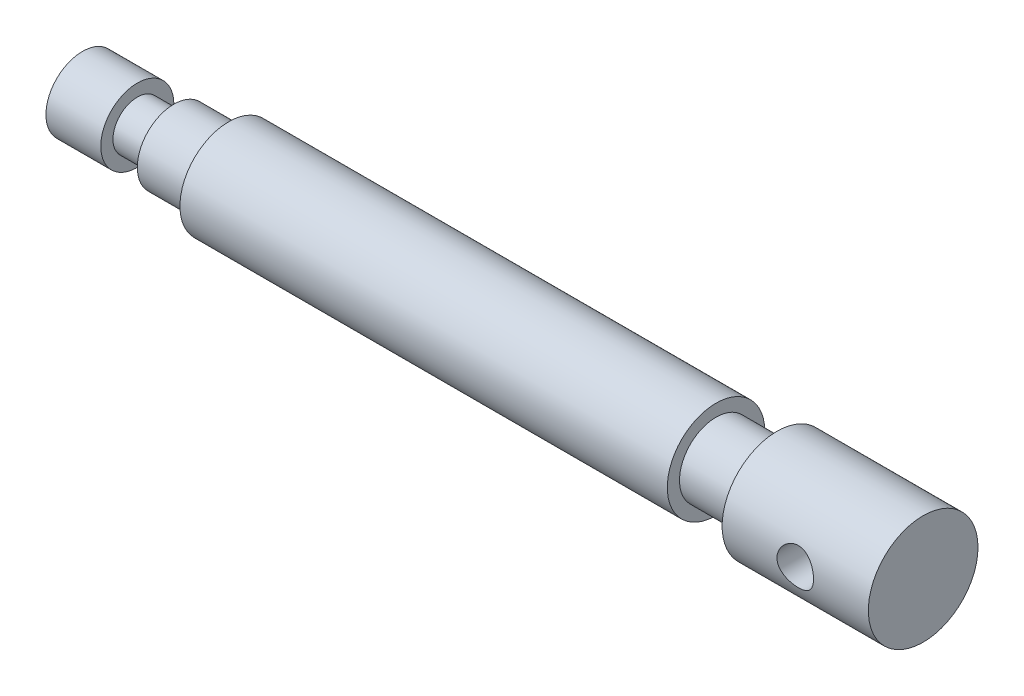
ISO-10303-21;
HEADER;
FILE_DESCRIPTION(('STEP AP214'),'2;1');
FILE_NAME('part.step','',(''),(''),'','','');
FILE_SCHEMA(('AUTOMOTIVE_DESIGN { 1 0 10303 214 1 1 1 1 }'));
ENDSEC;
DATA;
#1=APPLICATION_CONTEXT('core data for automotive mechanical design processes');
#2=APPLICATION_PROTOCOL_DEFINITION('international standard','automotive_design',2000,#1);
#3=PRODUCT_CONTEXT('',#1,'mechanical');
#4=PRODUCT('Part','Part','',(#3));
#5=PRODUCT_RELATED_PRODUCT_CATEGORY('part','',(#4));
#6=PRODUCT_DEFINITION_FORMATION('','',#4);
#7=PRODUCT_DEFINITION_CONTEXT('part definition',#1,'design');
#8=PRODUCT_DEFINITION('design','',#6,#7);
#9=PRODUCT_DEFINITION_SHAPE('','',#8);
#10=(LENGTH_UNIT() NAMED_UNIT(*) SI_UNIT(.MILLI.,.METRE.));
#11=(NAMED_UNIT(*) PLANE_ANGLE_UNIT() SI_UNIT($,.RADIAN.));
#12=(NAMED_UNIT(*) SI_UNIT($,.STERADIAN.) SOLID_ANGLE_UNIT());
#13=UNCERTAINTY_MEASURE_WITH_UNIT(LENGTH_MEASURE(1.E-05),#10,'distance_accuracy_value','');
#14=(GEOMETRIC_REPRESENTATION_CONTEXT(3) GLOBAL_UNCERTAINTY_ASSIGNED_CONTEXT((#13)) GLOBAL_UNIT_ASSIGNED_CONTEXT((#10,
#11,#12)) REPRESENTATION_CONTEXT('',''));
#15=CARTESIAN_POINT('',(0.,0.,0.));
#16=DIRECTION('',(0.,0.,1.));
#17=DIRECTION('',(1.,0.,0.));
#18=AXIS2_PLACEMENT_3D('',#15,#16,#17);
#19=CARTESIAN_POINT('',(0.,0.,0.));
#20=DIRECTION('',(-1.,0.,0.));
#21=DIRECTION('',(0.,0.,1.));
#22=AXIS2_PLACEMENT_3D('',#19,#20,#21);
#23=PLANE('',#22);
#24=CARTESIAN_POINT('',(0.,0.,0.));
#25=DIRECTION('',(1.,0.,0.));
#26=DIRECTION('',(0.,0.,-1.));
#27=AXIS2_PLACEMENT_3D('',#24,#25,#26);
#28=CIRCLE('',#27,6.);
#29=CARTESIAN_POINT('',(0.,0.,-6.));
#30=VERTEX_POINT('',#29);
#31=EDGE_CURVE('E10',#30,#30,#28,.T.);
#32=ORIENTED_EDGE('',*,*,#31,.F.);
#33=EDGE_LOOP('',(#32));
#34=FACE_BOUND('',#33,.T.);
#35=ADVANCED_FACE('F31',(#34),#23,.T.);
#36=CARTESIAN_POINT('',(0.,0.,0.));
#37=DIRECTION('',(1.,0.,0.));
#38=DIRECTION('',(0.,0.,-1.));
#39=AXIS2_PLACEMENT_3D('',#36,#37,#38);
#40=CYLINDRICAL_SURFACE('',#39,6.);
#41=ORIENTED_EDGE('',*,*,#31,.T.);
#42=EDGE_LOOP('',(#41));
#43=FACE_BOUND('',#42,.T.);
#44=CARTESIAN_POINT('',(9.,0.,0.));
#45=DIRECTION('',(1.,0.,0.));
#46=DIRECTION('',(0.,0.,-1.));
#47=AXIS2_PLACEMENT_3D('',#44,#45,#46);
#48=CIRCLE('',#47,6.);
#49=CARTESIAN_POINT('',(9.,0.,-6.));
#50=VERTEX_POINT('',#49);
#51=EDGE_CURVE('E42',#50,#50,#48,.T.);
#52=ORIENTED_EDGE('',*,*,#51,.F.);
#53=EDGE_LOOP('',(#52));
#54=FACE_BOUND('',#53,.T.);
#55=ADVANCED_FACE('F73',(#43,#54),#40,.T.);
#56=CARTESIAN_POINT('',(9.,6.,0.));
#57=DIRECTION('',(1.,0.,0.));
#58=DIRECTION('',(0.,0.,-1.));
#59=AXIS2_PLACEMENT_3D('',#56,#57,#58);
#60=PLANE('',#59);
#61=ORIENTED_EDGE('',*,*,#51,.T.);
#62=EDGE_LOOP('',(#61));
#63=FACE_BOUND('',#62,.T.);
#64=CARTESIAN_POINT('',(9.,0.,0.));
#65=DIRECTION('',(1.,0.,0.));
#66=DIRECTION('',(0.,0.,-1.));
#67=AXIS2_PLACEMENT_3D('',#64,#65,#66);
#68=CIRCLE('',#67,4.);
#69=CARTESIAN_POINT('',(9.,0.,-4.));
#70=VERTEX_POINT('',#69);
#71=EDGE_CURVE('E47',#70,#70,#68,.T.);
#72=ORIENTED_EDGE('',*,*,#71,.F.);
#73=EDGE_LOOP('',(#72));
#74=FACE_BOUND('',#73,.T.);
#75=ADVANCED_FACE('F78',(#63,#74),#60,.T.);
#76=CARTESIAN_POINT('',(0.,0.,0.));
#77=DIRECTION('',(1.,0.,0.));
#78=DIRECTION('',(0.,0.,-1.));
#79=AXIS2_PLACEMENT_3D('',#76,#77,#78);
#80=CYLINDRICAL_SURFACE('',#79,4.);
#81=ORIENTED_EDGE('',*,*,#71,.T.);
#82=EDGE_LOOP('',(#81));
#83=FACE_BOUND('',#82,.T.);
#84=CARTESIAN_POINT('',(15.,0.,0.));
#85=DIRECTION('',(1.,0.,0.));
#86=DIRECTION('',(0.,0.,-1.));
#87=AXIS2_PLACEMENT_3D('',#84,#85,#86);
#88=CIRCLE('',#87,4.);
#89=CARTESIAN_POINT('',(15.,0.,-4.));
#90=VERTEX_POINT('',#89);
#91=EDGE_CURVE('E145',#90,#90,#88,.T.);
#92=ORIENTED_EDGE('',*,*,#91,.F.);
#93=EDGE_LOOP('',(#92));
#94=FACE_BOUND('',#93,.T.);
#95=ADVANCED_FACE('F82',(#83,#94),#80,.T.);
#96=CARTESIAN_POINT('',(15.,4.,0.));
#97=DIRECTION('',(-1.,0.,0.));
#98=DIRECTION('',(0.,0.,1.));
#99=AXIS2_PLACEMENT_3D('',#96,#97,#98);
#100=PLANE('',#99);
#101=ORIENTED_EDGE('',*,*,#91,.T.);
#102=EDGE_LOOP('',(#101));
#103=FACE_BOUND('',#102,.T.);
#104=CARTESIAN_POINT('',(15.,0.,0.));
#105=DIRECTION('',(1.,0.,0.));
#106=DIRECTION('',(0.,0.,-1.));
#107=AXIS2_PLACEMENT_3D('',#104,#105,#106);
#108=CIRCLE('',#107,6.);
#109=CARTESIAN_POINT('',(15.,0.,-6.));
#110=VERTEX_POINT('',#109);
#111=EDGE_CURVE('E142',#110,#110,#108,.T.);
#112=ORIENTED_EDGE('',*,*,#111,.F.);
#113=EDGE_LOOP('',(#112));
#114=FACE_BOUND('',#113,.T.);
#115=ADVANCED_FACE('F89',(#103,#114),#100,.T.);
#116=CARTESIAN_POINT('',(0.,0.,0.));
#117=DIRECTION('',(1.,0.,0.));
#118=DIRECTION('',(0.,0.,-1.));
#119=AXIS2_PLACEMENT_3D('',#116,#117,#118);
#120=CYLINDRICAL_SURFACE('',#119,6.);
#121=ORIENTED_EDGE('',*,*,#111,.T.);
#122=EDGE_LOOP('',(#121));
#123=FACE_BOUND('',#122,.T.);
#124=CARTESIAN_POINT('',(24.,0.,0.));
#125=DIRECTION('',(1.,0.,0.));
#126=DIRECTION('',(0.,0.,-1.));
#127=AXIS2_PLACEMENT_3D('',#124,#125,#126);
#128=CIRCLE('',#127,6.);
#129=CARTESIAN_POINT('',(24.,0.,-6.));
#130=VERTEX_POINT('',#129);
#131=EDGE_CURVE('E139',#130,#130,#128,.T.);
#132=ORIENTED_EDGE('',*,*,#131,.F.);
#133=EDGE_LOOP('',(#132));
#134=FACE_BOUND('',#133,.T.);
#135=ADVANCED_FACE('F93',(#123,#134),#120,.T.);
#136=CARTESIAN_POINT('',(24.,6.,0.));
#137=DIRECTION('',(-1.,0.,0.));
#138=DIRECTION('',(0.,0.,1.));
#139=AXIS2_PLACEMENT_3D('',#136,#137,#138);
#140=PLANE('',#139);
#141=ORIENTED_EDGE('',*,*,#131,.T.);
#142=EDGE_LOOP('',(#141));
#143=FACE_BOUND('',#142,.T.);
#144=CARTESIAN_POINT('',(24.,0.,0.));
#145=DIRECTION('',(1.,0.,0.));
#146=DIRECTION('',(0.,0.,-1.));
#147=AXIS2_PLACEMENT_3D('',#144,#145,#146);
#148=CIRCLE('',#147,8.);
#149=CARTESIAN_POINT('',(24.,0.,-8.));
#150=VERTEX_POINT('',#149);
#151=EDGE_CURVE('E136',#150,#150,#148,.T.);
#152=ORIENTED_EDGE('',*,*,#151,.F.);
#153=EDGE_LOOP('',(#152));
#154=FACE_BOUND('',#153,.T.);
#155=ADVANCED_FACE('F97',(#143,#154),#140,.T.);
#156=CARTESIAN_POINT('',(0.,0.,0.));
#157=DIRECTION('',(1.,0.,0.));
#158=DIRECTION('',(0.,0.,-1.));
#159=AXIS2_PLACEMENT_3D('',#156,#157,#158);
#160=CYLINDRICAL_SURFACE('',#159,8.);
#161=ORIENTED_EDGE('',*,*,#151,.T.);
#162=EDGE_LOOP('',(#161));
#163=FACE_BOUND('',#162,.T.);
#164=CARTESIAN_POINT('',(104.,0.,0.));
#165=DIRECTION('',(1.,0.,0.));
#166=DIRECTION('',(0.,0.,-1.));
#167=AXIS2_PLACEMENT_3D('',#164,#165,#166);
#168=CIRCLE('',#167,8.);
#169=CARTESIAN_POINT('',(104.,0.,-8.));
#170=VERTEX_POINT('',#169);
#171=EDGE_CURVE('E133',#170,#170,#168,.T.);
#172=ORIENTED_EDGE('',*,*,#171,.F.);
#173=EDGE_LOOP('',(#172));
#174=FACE_BOUND('',#173,.T.);
#175=ADVANCED_FACE('F101',(#163,#174),#160,.T.);
#176=CARTESIAN_POINT('',(104.,8.,0.));
#177=DIRECTION('',(1.,0.,0.));
#178=DIRECTION('',(0.,0.,-1.));
#179=AXIS2_PLACEMENT_3D('',#176,#177,#178);
#180=PLANE('',#179);
#181=ORIENTED_EDGE('',*,*,#171,.T.);
#182=EDGE_LOOP('',(#181));
#183=FACE_BOUND('',#182,.T.);
#184=CARTESIAN_POINT('',(104.,0.,0.));
#185=DIRECTION('',(1.,0.,0.));
#186=DIRECTION('',(0.,0.,-1.));
#187=AXIS2_PLACEMENT_3D('',#184,#185,#186);
#188=CIRCLE('',#187,6.);
#189=CARTESIAN_POINT('',(104.,0.,-6.));
#190=VERTEX_POINT('',#189);
#191=EDGE_CURVE('E127',#190,#190,#188,.T.);
#192=ORIENTED_EDGE('',*,*,#191,.F.);
#193=EDGE_LOOP('',(#192));
#194=FACE_BOUND('',#193,.T.);
#195=ADVANCED_FACE('F105',(#183,#194),#180,.T.);
#196=CARTESIAN_POINT('',(0.,0.,0.));
#197=DIRECTION('',(1.,0.,0.));
#198=DIRECTION('',(0.,0.,-1.));
#199=AXIS2_PLACEMENT_3D('',#196,#197,#198);
#200=CYLINDRICAL_SURFACE('',#199,6.);
#201=ORIENTED_EDGE('',*,*,#191,.T.);
#202=EDGE_LOOP('',(#201));
#203=FACE_BOUND('',#202,.T.);
#204=CARTESIAN_POINT('',(114.,0.,0.));
#205=DIRECTION('',(1.,0.,0.));
#206=DIRECTION('',(0.,0.,-1.));
#207=AXIS2_PLACEMENT_3D('',#204,#205,#206);
#208=CIRCLE('',#207,6.);
#209=CARTESIAN_POINT('',(114.,0.,-6.));
#210=VERTEX_POINT('',#209);
#211=EDGE_CURVE('E120',#210,#210,#208,.T.);
#212=ORIENTED_EDGE('',*,*,#211,.F.);
#213=EDGE_LOOP('',(#212));
#214=FACE_BOUND('',#213,.T.);
#215=ADVANCED_FACE('F109',(#203,#214),#200,.T.);
#216=CARTESIAN_POINT('',(114.,6.,0.));
#217=DIRECTION('',(-1.,0.,0.));
#218=DIRECTION('',(0.,0.,1.));
#219=AXIS2_PLACEMENT_3D('',#216,#217,#218);
#220=PLANE('',#219);
#221=ORIENTED_EDGE('',*,*,#211,.T.);
#222=EDGE_LOOP('',(#221));
#223=FACE_BOUND('',#222,.T.);
#224=CARTESIAN_POINT('',(114.,0.,0.));
#225=DIRECTION('',(1.,0.,0.));
#226=DIRECTION('',(0.,0.,-1.));
#227=AXIS2_PLACEMENT_3D('',#224,#225,#226);
#228=CIRCLE('',#227,9.00000000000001);
#229=CARTESIAN_POINT('',(114.,0.,-9.00000000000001));
#230=VERTEX_POINT('',#229);
#231=EDGE_CURVE('E123',#230,#230,#228,.T.);
#232=ORIENTED_EDGE('',*,*,#231,.F.);
#233=EDGE_LOOP('',(#232));
#234=FACE_BOUND('',#233,.T.);
#235=ADVANCED_FACE('F69',(#223,#234),#220,.T.);
#236=CARTESIAN_POINT('',(0.,0.,0.));
#237=DIRECTION('',(1.,0.,0.));
#238=DIRECTION('',(0.,0.,-1.));
#239=AXIS2_PLACEMENT_3D('',#236,#237,#238);
#240=CYLINDRICAL_SURFACE('',#239,9.00000000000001);
#241=CARTESIAN_POINT('',(123.,0.,-9.00000000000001));
#242=CARTESIAN_POINT('',(122.999999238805,0.16369008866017,-9.00000045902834));
#243=CARTESIAN_POINT('',(123.013440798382,0.327375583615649,-8.99549308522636));
#244=CARTESIAN_POINT('',(123.066687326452,0.649925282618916,-8.97795630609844));
#245=CARTESIAN_POINT('',(123.106495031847,0.808788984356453,-8.96492601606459));
#246=CARTESIAN_POINT('',(123.210957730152,1.11699836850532,-8.93175923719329));
#247=CARTESIAN_POINT('',(123.275571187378,1.2663594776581,-8.91163463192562));
#248=CARTESIAN_POINT('',(123.427623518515,1.55212481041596,-8.86633337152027));
#249=CARTESIAN_POINT('',(123.515066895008,1.68852647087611,-8.84115572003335));
#250=CARTESIAN_POINT('',(123.713477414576,1.94922502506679,-8.78742283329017));
#251=CARTESIAN_POINT('',(123.825093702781,2.07301110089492,-8.75878669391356));
#252=CARTESIAN_POINT('',(124.06730146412,2.30049807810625,-8.70180944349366));
#253=CARTESIAN_POINT('',(124.197897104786,2.40419455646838,-8.67346839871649));
#254=CARTESIAN_POINT('',(124.478955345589,2.59147482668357,-8.61939997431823));
#255=CARTESIAN_POINT('',(124.629881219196,2.67439457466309,-8.59377117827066));
#256=CARTESIAN_POINT('',(124.944528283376,2.81345662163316,-8.54925916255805));
#257=CARTESIAN_POINT('',(125.108245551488,2.86960709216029,-8.53037388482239));
#258=CARTESIAN_POINT('',(125.43801966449,2.95162038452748,-8.50233909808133));
#259=CARTESIAN_POINT('',(125.603811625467,2.9784403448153,-8.49288287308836));
#260=CARTESIAN_POINT('',(125.937791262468,3.00402337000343,-8.48386969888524));
#261=CARTESIAN_POINT('',(126.105978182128,3.00279510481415,-8.48430969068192));
#262=CARTESIAN_POINT('',(126.431809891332,2.97305971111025,-8.49477045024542));
#263=CARTESIAN_POINT('',(126.589585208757,2.94580173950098,-8.50435247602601));
#264=CARTESIAN_POINT('',(126.898180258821,2.86681848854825,-8.53129973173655));
#265=CARTESIAN_POINT('',(127.048999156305,2.81509027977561,-8.54866589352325));
#266=CARTESIAN_POINT('',(127.342238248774,2.68781717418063,-8.58953733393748));
#267=CARTESIAN_POINT('',(127.484484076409,2.61190214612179,-8.61313697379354));
#268=CARTESIAN_POINT('',(127.754612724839,2.43866731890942,-8.6637767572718));
#269=CARTESIAN_POINT('',(127.8824913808,2.34134133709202,-8.69081789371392));
#270=CARTESIAN_POINT('',(128.127274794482,2.12204799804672,-8.74701987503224));
#271=CARTESIAN_POINT('',(128.243258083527,1.99905945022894,-8.7762176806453));
#272=CARTESIAN_POINT('',(128.45319379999,1.73501870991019,-8.83220815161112));
#273=CARTESIAN_POINT('',(128.547144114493,1.59396478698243,-8.85900058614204));
#274=CARTESIAN_POINT('',(128.711088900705,1.29584283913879,-8.90751323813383));
#275=CARTESIAN_POINT('',(128.780836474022,1.138629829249,-8.92918050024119));
#276=CARTESIAN_POINT('',(128.892609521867,0.813807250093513,-8.96461701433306));
#277=CARTESIAN_POINT('',(128.93464462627,0.646201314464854,-8.97838900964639));
#278=CARTESIAN_POINT('',(128.988166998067,0.313151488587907,-8.99602881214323));
#279=CARTESIAN_POINT('',(129.000899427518,0.147928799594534,-9.00030005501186));
#280=CARTESIAN_POINT('',(128.999001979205,-0.182325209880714,-8.99966708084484));
#281=CARTESIAN_POINT('',(128.98437672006,-0.347356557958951,-8.99476441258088));
#282=CARTESIAN_POINT('',(128.929164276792,-0.667559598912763,-8.97660074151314));
#283=CARTESIAN_POINT('',(128.889341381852,-0.822878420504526,-8.96358596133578));
#284=CARTESIAN_POINT('',(128.7858196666,-1.12456787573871,-8.93075540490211));
#285=CARTESIAN_POINT('',(128.722117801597,-1.27093736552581,-8.91093876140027));
#286=CARTESIAN_POINT('',(128.570788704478,-1.55486488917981,-8.86586793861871));
#287=CARTESIAN_POINT('',(128.48257622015,-1.69208987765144,-8.8404844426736));
#288=CARTESIAN_POINT('',(128.28541754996,-1.95019449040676,-8.78715761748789));
#289=CARTESIAN_POINT('',(128.176465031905,-2.07106910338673,-8.75921350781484));
#290=CARTESIAN_POINT('',(127.93506374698,-2.29875752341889,-8.70230543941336));
#291=CARTESIAN_POINT('',(127.801772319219,-2.40468290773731,-8.67335283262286));
#292=CARTESIAN_POINT('',(127.518685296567,-2.59277256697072,-8.61899919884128));
#293=CARTESIAN_POINT('',(127.368889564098,-2.67493664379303,-8.59359820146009));
#294=CARTESIAN_POINT('',(127.05698095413,-2.81279079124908,-8.54947175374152));
#295=CARTESIAN_POINT('',(126.894893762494,-2.86853439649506,-8.53073282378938));
#296=CARTESIAN_POINT('',(126.562864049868,-2.95168400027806,-8.5023249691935));
#297=CARTESIAN_POINT('',(126.392925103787,-2.97910276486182,-8.4926519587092));
#298=CARTESIAN_POINT('',(126.059408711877,-3.00382884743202,-8.48393576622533));
#299=CARTESIAN_POINT('',(125.89595297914,-3.00261077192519,-8.48437200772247));
#300=CARTESIAN_POINT('',(125.571704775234,-2.97372688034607,-8.49453809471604));
#301=CARTESIAN_POINT('',(125.410912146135,-2.94606263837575,-8.50426738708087));
#302=CARTESIAN_POINT('',(125.099593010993,-2.86611543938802,-8.53153572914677));
#303=CARTESIAN_POINT('',(124.948929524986,-2.81431003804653,-8.54892294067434));
#304=CARTESIAN_POINT('',(124.658317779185,-2.68793809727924,-8.58949196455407));
#305=CARTESIAN_POINT('',(124.518371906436,-2.61336650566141,-8.61267506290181));
#306=CARTESIAN_POINT('',(124.246548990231,-2.43978207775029,-8.6634848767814));
#307=CARTESIAN_POINT('',(124.115290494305,-2.33984472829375,-8.69126134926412));
#308=CARTESIAN_POINT('',(123.870930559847,-2.11992864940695,-8.7475006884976));
#309=CARTESIAN_POINT('',(123.757834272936,-1.99994425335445,-8.77596374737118));
#310=CARTESIAN_POINT('',(123.548566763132,-1.73772467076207,-8.83170091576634));
#311=CARTESIAN_POINT('',(123.453226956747,-1.59480454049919,-8.85888545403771));
#312=CARTESIAN_POINT('',(123.288028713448,-1.29407207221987,-8.90777973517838));
#313=CARTESIAN_POINT('',(123.218163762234,-1.13626355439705,-8.92949087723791));
#314=CARTESIAN_POINT('',(123.108835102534,-0.817480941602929,-8.96416545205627));
#315=CARTESIAN_POINT('',(123.06815260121,-0.656963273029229,-8.97747637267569));
#316=CARTESIAN_POINT('',(123.013739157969,-0.330961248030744,-8.99539221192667));
#317=CARTESIAN_POINT('',(123.00000076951,-0.16547827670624,-8.99999953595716));
#318=CARTESIAN_POINT('',(123.,0.,-9.00000000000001));
#319=B_SPLINE_CURVE_WITH_KNOTS('',3,(#241,#242,#243,#244,#245,#246,#247,#248,#249,#250,#251,
#252,#253,#254,#255,#256,#257,#258,#259,#260,#261,#262,#263,#264,#265,#266,#267,#268,#269,#270,
#271,#272,#273,#274,#275,#276,#277,#278,#279,#280,#281,#282,#283,#284,#285,#286,#287,#288,#289,
#290,#291,#292,#293,#294,#295,#296,#297,#298,#299,#300,#301,#302,#303,#304,#305,#306,#307,#308,
#309,#310,#311,#312,#313,#314,#315,#316,#317,#318),.UNSPECIFIED.,.T.,.F.,(4,2,2,2,2,2,2,2,2,2,2,
2,2,2,2,2,2,2,2,2,2,2,2,2,2,2,2,2,2,2,2,2,2,2,2,2,2,2,4),(0.,0.490461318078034,
0.980973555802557,1.47066801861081,1.96045913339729,2.46554052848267,2.9707329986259,
3.4904515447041,4.01001134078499,4.51205777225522,5.01394901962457,5.49290479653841,
5.97191792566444,6.4586451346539,6.94551307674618,7.45779917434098,7.97013437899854,
8.48755216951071,9.00479006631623,9.49960749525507,9.99434139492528,10.4747447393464,
10.9552093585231,11.4483119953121,11.9415654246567,12.4572306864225,12.9729002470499,
13.4875204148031,14.0019085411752,14.4898699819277,14.9778023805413,15.4564676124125,
15.9352391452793,16.4349020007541,16.9347063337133,17.453989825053,17.9731404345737,
18.4690967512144,18.9649159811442),.UNSPECIFIED.);
#320=CARTESIAN_POINT('',(123.,0.,-9.00000000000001));
#321=VERTEX_POINT('',#320);
#322=EDGE_CURVE('E34',#321,#321,#319,.T.);
#323=ORIENTED_EDGE('',*,*,#322,.F.);
#324=EDGE_LOOP('',(#323));
#325=FACE_BOUND('',#324,.T.);
#326=CARTESIAN_POINT('',(129.,0.,9.00000000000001));
#327=CARTESIAN_POINT('',(129.000000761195,0.163690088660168,9.00000045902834));
#328=CARTESIAN_POINT('',(128.986559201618,0.327375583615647,8.99549308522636));
#329=CARTESIAN_POINT('',(128.933312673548,0.649925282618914,8.97795630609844));
#330=CARTESIAN_POINT('',(128.893504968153,0.808788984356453,8.96492601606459));
#331=CARTESIAN_POINT('',(128.789042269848,1.11699836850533,8.93175923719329));
#332=CARTESIAN_POINT('',(128.724428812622,1.26635947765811,8.91163463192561));
#333=CARTESIAN_POINT('',(128.572376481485,1.55212481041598,8.86633337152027));
#334=CARTESIAN_POINT('',(128.484933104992,1.68852647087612,8.84115572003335));
#335=CARTESIAN_POINT('',(128.286522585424,1.94922502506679,8.78742283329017));
#336=CARTESIAN_POINT('',(128.174906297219,2.07301110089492,8.75878669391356));
#337=CARTESIAN_POINT('',(127.93269853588,2.30049807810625,8.70180944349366));
#338=CARTESIAN_POINT('',(127.802102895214,2.40419455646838,8.67346839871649));
#339=CARTESIAN_POINT('',(127.521044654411,2.59147482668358,8.61939997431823));
#340=CARTESIAN_POINT('',(127.370118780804,2.6743945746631,8.59377117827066));
#341=CARTESIAN_POINT('',(127.055471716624,2.81345662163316,8.54925916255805));
#342=CARTESIAN_POINT('',(126.891754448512,2.86960709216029,8.53037388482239));
#343=CARTESIAN_POINT('',(126.56198033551,2.95162038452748,8.50233909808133));
#344=CARTESIAN_POINT('',(126.396188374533,2.9784403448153,8.49288287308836));
#345=CARTESIAN_POINT('',(126.062208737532,3.00402337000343,8.48386969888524));
#346=CARTESIAN_POINT('',(125.894021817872,3.00279510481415,8.48430969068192));
#347=CARTESIAN_POINT('',(125.568190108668,2.97305971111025,8.49477045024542));
#348=CARTESIAN_POINT('',(125.410414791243,2.94580173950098,8.50435247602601));
#349=CARTESIAN_POINT('',(125.101819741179,2.86681848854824,8.53129973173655));
#350=CARTESIAN_POINT('',(124.951000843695,2.8150902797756,8.54866589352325));
#351=CARTESIAN_POINT('',(124.657761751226,2.68781717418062,8.58953733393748));
#352=CARTESIAN_POINT('',(124.515515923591,2.61190214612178,8.61313697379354));
#353=CARTESIAN_POINT('',(124.245387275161,2.43866731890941,8.66377675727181));
#354=CARTESIAN_POINT('',(124.1175086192,2.34134133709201,8.69081789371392));
#355=CARTESIAN_POINT('',(123.872725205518,2.1220479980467,8.74701987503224));
#356=CARTESIAN_POINT('',(123.756741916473,1.99905945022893,8.7762176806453));
#357=CARTESIAN_POINT('',(123.54680620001,1.73501870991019,8.83220815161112));
#358=CARTESIAN_POINT('',(123.452855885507,1.59396478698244,8.85900058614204));
#359=CARTESIAN_POINT('',(123.288911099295,1.2958428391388,8.90751323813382));
#360=CARTESIAN_POINT('',(123.219163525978,1.138629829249,8.92918050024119));
#361=CARTESIAN_POINT('',(123.107390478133,0.813807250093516,8.96461701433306));
#362=CARTESIAN_POINT('',(123.06535537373,0.646201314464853,8.97838900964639));
#363=CARTESIAN_POINT('',(123.011833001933,0.313151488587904,8.99602881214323));
#364=CARTESIAN_POINT('',(122.999100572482,0.147928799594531,9.00030005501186));
#365=CARTESIAN_POINT('',(123.000998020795,-0.182325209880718,8.99966708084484));
#366=CARTESIAN_POINT('',(123.01562327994,-0.347356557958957,8.99476441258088));
#367=CARTESIAN_POINT('',(123.070835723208,-0.667559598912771,8.97660074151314));
#368=CARTESIAN_POINT('',(123.110658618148,-0.822878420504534,8.96358596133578));
#369=CARTESIAN_POINT('',(123.2141803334,-1.12456787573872,8.93075540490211));
#370=CARTESIAN_POINT('',(123.277882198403,-1.27093736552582,8.91093876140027));
#371=CARTESIAN_POINT('',(123.429211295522,-1.55486488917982,8.86586793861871));
#372=CARTESIAN_POINT('',(123.51742377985,-1.69208987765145,8.8404844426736));
#373=CARTESIAN_POINT('',(123.71458245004,-1.95019449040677,8.78715761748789));
#374=CARTESIAN_POINT('',(123.823534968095,-2.07106910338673,8.75921350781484));
#375=CARTESIAN_POINT('',(124.06493625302,-2.2987575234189,8.70230543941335));
#376=CARTESIAN_POINT('',(124.198227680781,-2.40468290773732,8.67335283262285));
#377=CARTESIAN_POINT('',(124.481314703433,-2.59277256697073,8.61899919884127));
#378=CARTESIAN_POINT('',(124.631110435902,-2.67493664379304,8.59359820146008));
#379=CARTESIAN_POINT('',(124.94301904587,-2.81279079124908,8.54947175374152));
#380=CARTESIAN_POINT('',(125.105106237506,-2.86853439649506,8.53073282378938));
#381=CARTESIAN_POINT('',(125.437135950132,-2.95168400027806,8.5023249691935));
#382=CARTESIAN_POINT('',(125.607074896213,-2.97910276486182,8.4926519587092));
#383=CARTESIAN_POINT('',(125.940591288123,-3.00382884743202,8.48393576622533));
#384=CARTESIAN_POINT('',(126.10404702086,-3.00261077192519,8.48437200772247));
#385=CARTESIAN_POINT('',(126.428295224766,-2.97372688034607,8.49453809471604));
#386=CARTESIAN_POINT('',(126.589087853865,-2.94606263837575,8.50426738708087));
#387=CARTESIAN_POINT('',(126.900406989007,-2.86611543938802,8.53153572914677));
#388=CARTESIAN_POINT('',(127.051070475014,-2.81431003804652,8.54892294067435));
#389=CARTESIAN_POINT('',(127.341682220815,-2.68793809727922,8.58949196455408));
#390=CARTESIAN_POINT('',(127.481628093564,-2.6133665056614,8.61267506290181));
#391=CARTESIAN_POINT('',(127.753451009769,-2.43978207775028,8.66348487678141));
#392=CARTESIAN_POINT('',(127.884709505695,-2.33984472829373,8.69126134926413));
#393=CARTESIAN_POINT('',(128.129069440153,-2.11992864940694,8.7475006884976));
#394=CARTESIAN_POINT('',(128.242165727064,-1.99994425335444,8.77596374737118));
#395=CARTESIAN_POINT('',(128.451433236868,-1.73772467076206,8.83170091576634));
#396=CARTESIAN_POINT('',(128.546773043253,-1.59480454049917,8.85888545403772));
#397=CARTESIAN_POINT('',(128.711971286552,-1.29407207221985,8.90777973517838));
#398=CARTESIAN_POINT('',(128.781836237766,-1.13626355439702,8.92949087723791));
#399=CARTESIAN_POINT('',(128.891164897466,-0.817480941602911,8.96416545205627));
#400=CARTESIAN_POINT('',(128.93184739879,-0.656963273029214,8.9774763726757));
#401=CARTESIAN_POINT('',(128.986260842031,-0.330961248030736,8.99539221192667));
#402=CARTESIAN_POINT('',(128.99999923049,-0.165478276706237,8.99999953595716));
#403=CARTESIAN_POINT('',(129.,0.,9.00000000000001));
#404=B_SPLINE_CURVE_WITH_KNOTS('',3,(#326,#327,#328,#329,#330,#331,#332,#333,#334,#335,#336,
#337,#338,#339,#340,#341,#342,#343,#344,#345,#346,#347,#348,#349,#350,#351,#352,#353,#354,#355,
#356,#357,#358,#359,#360,#361,#362,#363,#364,#365,#366,#367,#368,#369,#370,#371,#372,#373,#374,
#375,#376,#377,#378,#379,#380,#381,#382,#383,#384,#385,#386,#387,#388,#389,#390,#391,#392,#393,
#394,#395,#396,#397,#398,#399,#400,#401,#402,#403),.UNSPECIFIED.,.T.,.F.,(4,2,2,2,2,2,2,2,2,2,2,
2,2,2,2,2,2,2,2,2,2,2,2,2,2,2,2,2,2,2,2,2,2,2,2,2,2,2,4),(0.,0.490461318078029,
0.980973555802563,1.47066801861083,1.96045913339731,2.46554052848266,2.97073299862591,
3.49045154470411,4.01001134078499,4.51205777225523,5.01394901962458,5.49290479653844,
5.97191792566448,6.45864513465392,6.94551307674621,7.457799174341,7.97013437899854,
8.48755216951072,9.00479006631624,9.49960749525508,9.99434139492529,10.4747447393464,
10.9552093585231,11.4483119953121,11.9415654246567,12.4572306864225,12.9729002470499,
13.4875204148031,14.0019085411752,14.4898699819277,14.9778023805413,15.4564676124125,
15.9352391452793,16.4349020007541,16.9347063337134,17.453989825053,17.9731404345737,
18.4690967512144,18.9649159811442),.UNSPECIFIED.);
#405=CARTESIAN_POINT('',(129.,0.,9.00000000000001));
#406=VERTEX_POINT('',#405);
#407=EDGE_CURVE('E50',#406,#406,#404,.T.);
#408=ORIENTED_EDGE('',*,*,#407,.F.);
#409=EDGE_LOOP('',(#408));
#410=FACE_BOUND('',#409,.T.);
#411=ORIENTED_EDGE('',*,*,#231,.T.);
#412=EDGE_LOOP('',(#411));
#413=FACE_BOUND('',#412,.T.);
#414=CARTESIAN_POINT('',(138.,0.,0.));
#415=DIRECTION('',(1.,0.,0.));
#416=DIRECTION('',(0.,0.,-1.));
#417=AXIS2_PLACEMENT_3D('',#414,#415,#416);
#418=CIRCLE('',#417,9.00000000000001);
#419=CARTESIAN_POINT('',(138.,0.,-9.00000000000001));
#420=VERTEX_POINT('',#419);
#421=EDGE_CURVE('E125',#420,#420,#418,.T.);
#422=ORIENTED_EDGE('',*,*,#421,.F.);
#423=EDGE_LOOP('',(#422));
#424=FACE_BOUND('',#423,.T.);
#425=ADVANCED_FACE('F54',(#325,#410,#413,#424),#240,.T.);
#426=CARTESIAN_POINT('',(138.,9.00000000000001,0.));
#427=DIRECTION('',(1.,0.,0.));
#428=DIRECTION('',(0.,0.,-1.));
#429=AXIS2_PLACEMENT_3D('',#426,#427,#428);
#430=PLANE('',#429);
#431=ORIENTED_EDGE('',*,*,#421,.T.);
#432=EDGE_LOOP('',(#431));
#433=FACE_BOUND('',#432,.T.);
#434=ADVANCED_FACE('F61',(#433),#430,.T.);
#435=CARTESIAN_POINT('',(126.,0.,-10.));
#436=DIRECTION('',(0.,0.,1.));
#437=DIRECTION('',(1.,0.,0.));
#438=AXIS2_PLACEMENT_3D('',#435,#436,#437);
#439=CYLINDRICAL_SURFACE('',#438,2.99999999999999);
#440=ORIENTED_EDGE('',*,*,#322,.T.);
#441=EDGE_LOOP('',(#440));
#442=FACE_BOUND('',#441,.T.);
#443=ORIENTED_EDGE('',*,*,#407,.T.);
#444=EDGE_LOOP('',(#443));
#445=FACE_BOUND('',#444,.T.);
#446=ADVANCED_FACE('F58',(#442,#445),#439,.F.);
#447=CLOSED_SHELL('',(#35,#55,#75,#95,#115,#135,#155,#175,#195,#215,#235,#425,#434,#446));
#448=MANIFOLD_SOLID_BREP('B2',#447);
#449=ADVANCED_BREP_SHAPE_REPRESENTATION('',(#18,#448),#14);
#450=SHAPE_DEFINITION_REPRESENTATION(#9,#449);
ENDSEC;
END-ISO-10303-21;
